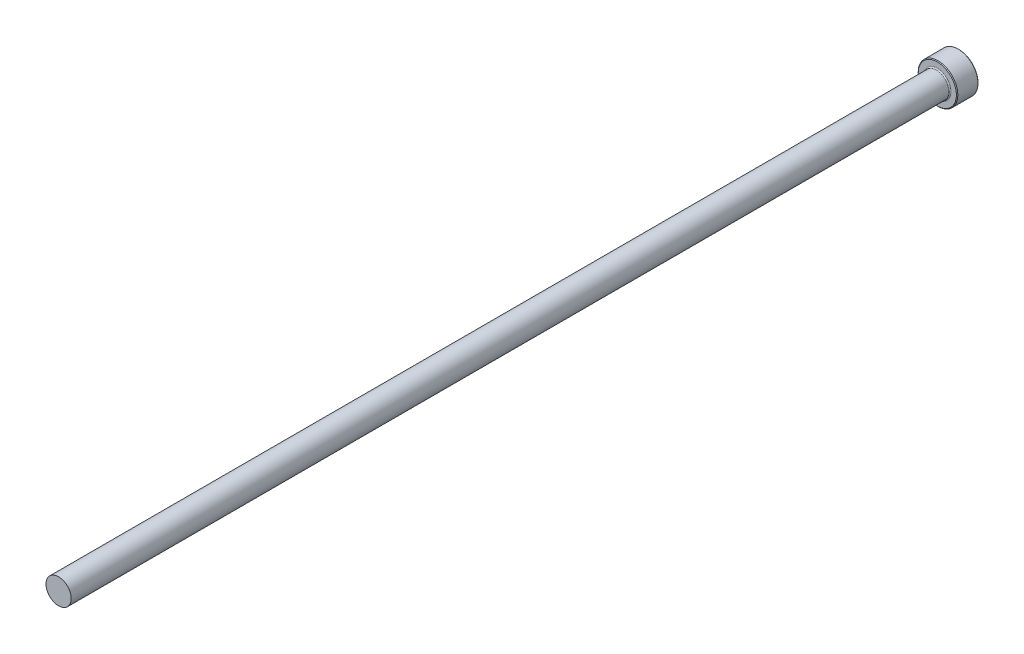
ISO-10303-21;
HEADER;
FILE_DESCRIPTION(('STEP AP214'),'2;1');
FILE_NAME('part.step','',(''),(''),'','','');
FILE_SCHEMA(('AUTOMOTIVE_DESIGN { 1 0 10303 214 1 1 1 1 }'));
ENDSEC;
DATA;
#1=APPLICATION_CONTEXT('core data for automotive mechanical design processes');
#2=APPLICATION_PROTOCOL_DEFINITION('international standard','automotive_design',2000,#1);
#3=PRODUCT_CONTEXT('',#1,'mechanical');
#4=PRODUCT('Part','Part','',(#3));
#5=PRODUCT_RELATED_PRODUCT_CATEGORY('part','',(#4));
#6=PRODUCT_DEFINITION_FORMATION('','',#4);
#7=PRODUCT_DEFINITION_CONTEXT('part definition',#1,'design');
#8=PRODUCT_DEFINITION('design','',#6,#7);
#9=PRODUCT_DEFINITION_SHAPE('','',#8);
#10=(LENGTH_UNIT() NAMED_UNIT(*) SI_UNIT(.MILLI.,.METRE.));
#11=(NAMED_UNIT(*) PLANE_ANGLE_UNIT() SI_UNIT($,.RADIAN.));
#12=(NAMED_UNIT(*) SI_UNIT($,.STERADIAN.) SOLID_ANGLE_UNIT());
#13=UNCERTAINTY_MEASURE_WITH_UNIT(LENGTH_MEASURE(1.E-05),#10,'distance_accuracy_value','');
#14=(GEOMETRIC_REPRESENTATION_CONTEXT(3) GLOBAL_UNCERTAINTY_ASSIGNED_CONTEXT((#13)) GLOBAL_UNIT_ASSIGNED_CONTEXT((#10,
#11,#12)) REPRESENTATION_CONTEXT('',''));
#15=CARTESIAN_POINT('',(0.,0.,0.));
#16=DIRECTION('',(0.,0.,1.));
#17=DIRECTION('',(1.,0.,0.));
#18=AXIS2_PLACEMENT_3D('',#15,#16,#17);
#19=CARTESIAN_POINT('',(0.,3.49999999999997,250.));
#20=DIRECTION('',(0.,0.,-1.));
#21=DIRECTION('',(-1.,0.,0.));
#22=AXIS2_PLACEMENT_3D('',#19,#20,#21);
#23=PLANE('',#22);
#24=CARTESIAN_POINT('',(0.,0.,250.));
#25=DIRECTION('',(0.,0.,1.));
#26=DIRECTION('',(1.,0.,0.));
#27=AXIS2_PLACEMENT_3D('',#24,#25,#26);
#28=CIRCLE('',#27,3.49999999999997);
#29=CARTESIAN_POINT('',(3.49999999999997,0.,250.));
#30=VERTEX_POINT('',#29);
#31=EDGE_CURVE('E50',#30,#30,#28,.T.);
#32=ORIENTED_EDGE('',*,*,#31,.T.);
#33=EDGE_LOOP('',(#32));
#34=FACE_BOUND('',#33,.T.);
#35=ADVANCED_FACE('F30',(#34),#23,.F.);
#36=CARTESIAN_POINT('',(0.,0.,109.050628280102));
#37=DIRECTION('',(0.,0.,1.));
#38=DIRECTION('',(1.,0.,0.));
#39=AXIS2_PLACEMENT_3D('',#36,#37,#38);
#40=CYLINDRICAL_SURFACE('',#39,3.49999999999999);
#41=ORIENTED_EDGE('',*,*,#31,.F.);
#42=EDGE_LOOP('',(#41));
#43=FACE_BOUND('',#42,.T.);
#44=CARTESIAN_POINT('',(0.,0.,6.3));
#45=DIRECTION('',(0.,0.,1.));
#46=DIRECTION('',(1.,0.,0.));
#47=AXIS2_PLACEMENT_3D('',#44,#45,#46);
#48=CIRCLE('',#47,3.5);
#49=CARTESIAN_POINT('',(3.5,0.,6.3));
#50=VERTEX_POINT('',#49);
#51=EDGE_CURVE('E53',#50,#50,#48,.T.);
#52=ORIENTED_EDGE('',*,*,#51,.T.);
#53=EDGE_LOOP('',(#52));
#54=FACE_BOUND('',#53,.T.);
#55=ADVANCED_FACE('F73',(#43,#54),#40,.T.);
#56=CARTESIAN_POINT('',(0.,0.,6.3));
#57=DIRECTION('',(0.,0.,1.));
#58=DIRECTION('',(1.,0.,0.));
#59=AXIS2_PLACEMENT_3D('',#56,#57,#58);
#60=TOROIDAL_SURFACE('',#59,3.8,0.3);
#61=ORIENTED_EDGE('',*,*,#51,.F.);
#62=EDGE_LOOP('',(#61));
#63=FACE_BOUND('',#62,.T.);
#64=CARTESIAN_POINT('',(0.,0.,6.00000000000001));
#65=DIRECTION('',(0.,0.,1.));
#66=DIRECTION('',(1.,0.,0.));
#67=AXIS2_PLACEMENT_3D('',#64,#65,#66);
#68=CIRCLE('',#67,3.8);
#69=CARTESIAN_POINT('',(3.8,0.,6.00000000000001));
#70=VERTEX_POINT('',#69);
#71=EDGE_CURVE('E56',#70,#70,#68,.T.);
#72=ORIENTED_EDGE('',*,*,#71,.T.);
#73=EDGE_LOOP('',(#72));
#74=FACE_BOUND('',#73,.T.);
#75=ADVANCED_FACE('F60',(#63,#74),#60,.F.);
#76=CARTESIAN_POINT('',(0.,5.5,6.));
#77=DIRECTION('',(0.,0.,-1.));
#78=DIRECTION('',(-1.,0.,0.));
#79=AXIS2_PLACEMENT_3D('',#76,#77,#78);
#80=PLANE('',#79);
#81=CARTESIAN_POINT('',(0.,0.,6.));
#82=DIRECTION('',(0.,0.,-1.));
#83=DIRECTION('',(-1.,0.,0.));
#84=AXIS2_PLACEMENT_3D('',#81,#82,#83);
#85=CIRCLE('',#84,5.3);
#86=CARTESIAN_POINT('',(-5.3,0.,6.));
#87=VERTEX_POINT('',#86);
#88=EDGE_CURVE('E10',#87,#87,#85,.F.);
#89=ORIENTED_EDGE('',*,*,#88,.T.);
#90=EDGE_LOOP('',(#89));
#91=FACE_BOUND('',#90,.T.);
#92=ORIENTED_EDGE('',*,*,#71,.F.);
#93=EDGE_LOOP('',(#92));
#94=FACE_BOUND('',#93,.T.);
#95=ADVANCED_FACE('F62',(#91,#94),#80,.F.);
#96=CARTESIAN_POINT('',(0.,0.,109.050628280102));
#97=DIRECTION('',(0.,0.,1.));
#98=DIRECTION('',(1.,0.,0.));
#99=AXIS2_PLACEMENT_3D('',#96,#97,#98);
#100=CYLINDRICAL_SURFACE('',#99,5.5);
#101=CARTESIAN_POINT('',(0.,0.,0.200000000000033));
#102=DIRECTION('',(0.,0.,1.));
#103=DIRECTION('',(1.,0.,0.));
#104=AXIS2_PLACEMENT_3D('',#101,#102,#103);
#105=CIRCLE('',#104,5.5);
#106=CARTESIAN_POINT('',(5.5,0.,0.200000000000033));
#107=VERTEX_POINT('',#106);
#108=EDGE_CURVE('E41',#107,#107,#105,.T.);
#109=ORIENTED_EDGE('',*,*,#108,.T.);
#110=EDGE_LOOP('',(#109));
#111=FACE_BOUND('',#110,.T.);
#112=CARTESIAN_POINT('',(0.,0.,5.8));
#113=DIRECTION('',(0.,0.,-1.));
#114=DIRECTION('',(-1.,0.,0.));
#115=AXIS2_PLACEMENT_3D('',#112,#113,#114);
#116=CIRCLE('',#115,5.5);
#117=CARTESIAN_POINT('',(-5.5,0.,5.8));
#118=VERTEX_POINT('',#117);
#119=EDGE_CURVE('E45',#118,#118,#116,.T.);
#120=ORIENTED_EDGE('',*,*,#119,.T.);
#121=EDGE_LOOP('',(#120));
#122=FACE_BOUND('',#121,.T.);
#123=ADVANCED_FACE('F64',(#111,#122),#100,.T.);
#124=CARTESIAN_POINT('',(0.,0.,0.));
#125=DIRECTION('',(0.,0.,1.));
#126=DIRECTION('',(1.,0.,0.));
#127=AXIS2_PLACEMENT_3D('',#124,#125,#126);
#128=PLANE('',#127);
#129=CARTESIAN_POINT('',(0.,0.,0.));
#130=DIRECTION('',(0.,0.,1.));
#131=DIRECTION('',(1.,0.,0.));
#132=AXIS2_PLACEMENT_3D('',#129,#130,#131);
#133=CIRCLE('',#132,5.29999999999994);
#134=CARTESIAN_POINT('',(5.29999999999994,0.,0.));
#135=VERTEX_POINT('',#134);
#136=EDGE_CURVE('E37',#135,#135,#133,.F.);
#137=ORIENTED_EDGE('',*,*,#136,.T.);
#138=EDGE_LOOP('',(#137));
#139=FACE_BOUND('',#138,.T.);
#140=ADVANCED_FACE('F70',(#139),#128,.F.);
#141=CARTESIAN_POINT('',(0.,0.,0.200000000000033));
#142=DIRECTION('',(0.,0.,1.));
#143=DIRECTION('',(1.,0.,0.));
#144=AXIS2_PLACEMENT_3D('',#141,#142,#143);
#145=CONICAL_SURFACE('',#144,5.5,0.785398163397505);
#146=ORIENTED_EDGE('',*,*,#136,.F.);
#147=EDGE_LOOP('',(#146));
#148=FACE_BOUND('',#147,.T.);
#149=ORIENTED_EDGE('',*,*,#108,.F.);
#150=EDGE_LOOP('',(#149));
#151=FACE_BOUND('',#150,.T.);
#152=ADVANCED_FACE('F84',(#148,#151),#145,.T.);
#153=CARTESIAN_POINT('',(0.,0.,6.00000000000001));
#154=DIRECTION('',(0.,0.,-1.));
#155=DIRECTION('',(-1.,0.,0.));
#156=AXIS2_PLACEMENT_3D('',#153,#154,#155);
#157=CONICAL_SURFACE('',#156,5.3,0.785398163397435);
#158=ORIENTED_EDGE('',*,*,#119,.F.);
#159=EDGE_LOOP('',(#158));
#160=FACE_BOUND('',#159,.T.);
#161=ORIENTED_EDGE('',*,*,#88,.F.);
#162=EDGE_LOOP('',(#161));
#163=FACE_BOUND('',#162,.T.);
#164=ADVANCED_FACE('F32',(#160,#163),#157,.T.);
#165=CLOSED_SHELL('',(#35,#55,#75,#95,#123,#140,#152,#164));
#166=MANIFOLD_SOLID_BREP('B2',#165);
#167=ADVANCED_BREP_SHAPE_REPRESENTATION('',(#18,#166),#14);
#168=SHAPE_DEFINITION_REPRESENTATION(#9,#167);
ENDSEC;
END-ISO-10303-21;
